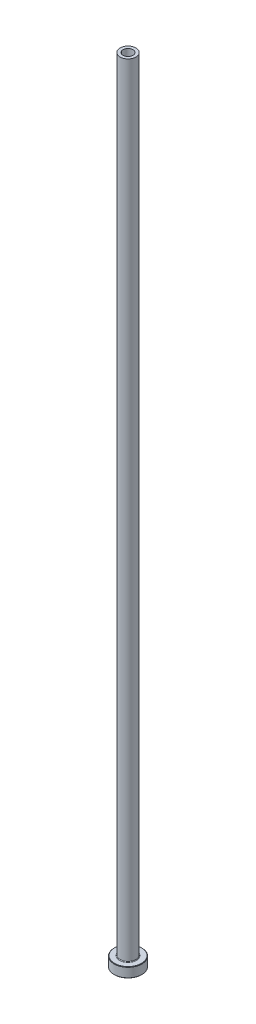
from build123d import *

# Parameters (mm, degrees)
FILLET1_R     = 0.3
CHAMFER1_SIZE = 0.2
CHAMFER3_SIZE = 0.5


with BuildPart() as part:
    # Sketch1 → Revolve1 (revolve)
    with BuildSketch(Plane.XY, mode=Mode.PRIVATE) as revolve1_sk:
        Polygon((-2.5, 400), (-4, 400), (-4, 5), (-7, 5), (-7, 0), (-2.75, 0), (-2.75, 343), (-2.5, 355), align=None)
    revolve(revolve1_sk.sketch.rotate(Axis((0, 92.187680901, 0), (0, -1, 0)), 270), axis=Axis((0, 92.187680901, 0), (0, -1, 0)))

    # Fillet1
    fillet1_edges = [part.edges().sort_by_distance(p)[0] for p in [
        (0, 5, -4),
    ]]
    fillet(fillet1_edges, radius=FILLET1_R)

    # Chamfer1
    chamfer1_edges = [part.edges().sort_by_distance(p)[0] for p in [
        (0, 0, -7),
        (0, 5, -7),
    ]]
    chamfer(chamfer1_edges, length=CHAMFER1_SIZE)

    # Chamfer3
    chamfer3_edges = [part.edges().sort_by_distance(p)[0] for p in [
        (0, 0, -2.75),
    ]]
    chamfer(chamfer3_edges, length=CHAMFER3_SIZE)


solid = part.part
